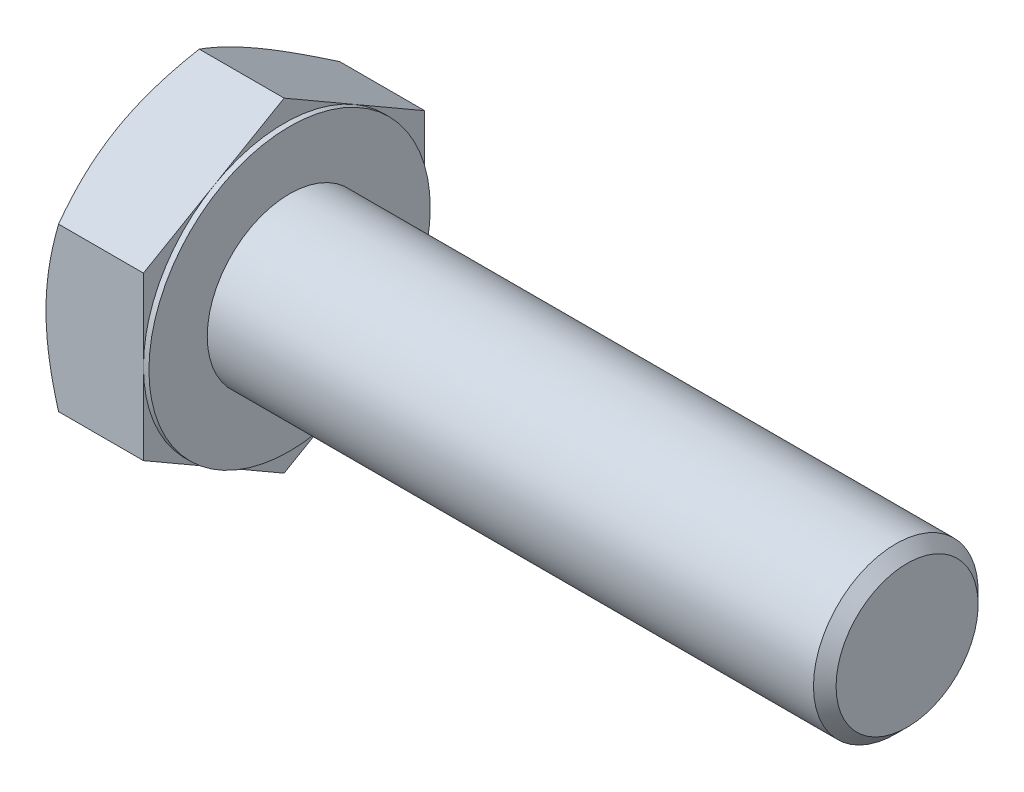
ISO-10303-21;
HEADER;
FILE_DESCRIPTION(('STEP AP214'),'2;1');
FILE_NAME('part.step','',(''),(''),'','','');
FILE_SCHEMA(('AUTOMOTIVE_DESIGN { 1 0 10303 214 1 1 1 1 }'));
ENDSEC;
DATA;
#1=APPLICATION_CONTEXT('core data for automotive mechanical design processes');
#2=APPLICATION_PROTOCOL_DEFINITION('international standard','automotive_design',2000,#1);
#3=PRODUCT_CONTEXT('',#1,'mechanical');
#4=PRODUCT('Part','Part','',(#3));
#5=PRODUCT_RELATED_PRODUCT_CATEGORY('part','',(#4));
#6=PRODUCT_DEFINITION_FORMATION('','',#4);
#7=PRODUCT_DEFINITION_CONTEXT('part definition',#1,'design');
#8=PRODUCT_DEFINITION('design','',#6,#7);
#9=PRODUCT_DEFINITION_SHAPE('','',#8);
#10=(LENGTH_UNIT() NAMED_UNIT(*) SI_UNIT(.MILLI.,.METRE.));
#11=(NAMED_UNIT(*) PLANE_ANGLE_UNIT() SI_UNIT($,.RADIAN.));
#12=(NAMED_UNIT(*) SI_UNIT($,.STERADIAN.) SOLID_ANGLE_UNIT());
#13=UNCERTAINTY_MEASURE_WITH_UNIT(LENGTH_MEASURE(1.E-05),#10,'distance_accuracy_value','');
#14=(GEOMETRIC_REPRESENTATION_CONTEXT(3) GLOBAL_UNCERTAINTY_ASSIGNED_CONTEXT((#13)) GLOBAL_UNIT_ASSIGNED_CONTEXT((#10,
#11,#12)) REPRESENTATION_CONTEXT('',''));
#15=CARTESIAN_POINT('',(0.,0.,0.));
#16=DIRECTION('',(0.,0.,1.));
#17=DIRECTION('',(1.,0.,0.));
#18=AXIS2_PLACEMENT_3D('',#15,#16,#17);
#19=CARTESIAN_POINT('',(15.,23.6713610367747,0.));
#20=DIRECTION('',(1.,0.,0.));
#21=DIRECTION('',(0.,0.,-1.));
#22=AXIS2_PLACEMENT_3D('',#19,#20,#21);
#23=PLANE('',#22);
#24=CARTESIAN_POINT('',(15.,0.,0.));
#25=DIRECTION('',(1.,0.,0.));
#26=DIRECTION('',(0.,0.,-1.));
#27=AXIS2_PLACEMENT_3D('',#24,#25,#26);
#28=CIRCLE('',#27,12.);
#29=CARTESIAN_POINT('',(15.,0.,-12.));
#30=VERTEX_POINT('',#29);
#31=EDGE_CURVE('E275',#30,#30,#28,.F.);
#32=ORIENTED_EDGE('',*,*,#31,.T.);
#33=EDGE_LOOP('',(#32));
#34=FACE_BOUND('',#33,.T.);
#35=CARTESIAN_POINT('',(15.,0.,0.));
#36=DIRECTION('',(1.,0.,0.));
#37=DIRECTION('',(0.,0.,-1.));
#38=AXIS2_PLACEMENT_3D('',#35,#36,#37);
#39=CIRCLE('',#38,20.5);
#40=CARTESIAN_POINT('',(15.,0.,-20.5));
#41=VERTEX_POINT('',#40);
#42=EDGE_CURVE('E294',#41,#41,#39,.T.);
#43=ORIENTED_EDGE('',*,*,#42,.T.);
#44=EDGE_LOOP('',(#43));
#45=FACE_BOUND('',#44,.T.);
#46=ADVANCED_FACE('F37',(#34,#45),#23,.T.);
#47=CARTESIAN_POINT('',(0.,0.,0.));
#48=DIRECTION('',(-1.,0.,0.));
#49=DIRECTION('',(0.,0.,1.));
#50=AXIS2_PLACEMENT_3D('',#47,#48,#49);
#51=CYLINDRICAL_SURFACE('',#50,12.);
#52=ORIENTED_EDGE('',*,*,#31,.F.);
#53=EDGE_LOOP('',(#52));
#54=FACE_BOUND('',#53,.T.);
#55=CARTESIAN_POINT('',(103.352,0.,0.));
#56=DIRECTION('',(-1.,0.,0.));
#57=DIRECTION('',(0.,0.,1.));
#58=AXIS2_PLACEMENT_3D('',#55,#56,#57);
#59=CIRCLE('',#58,12.);
#60=CARTESIAN_POINT('',(103.352,0.,12.));
#61=VERTEX_POINT('',#60);
#62=EDGE_CURVE('E272',#61,#61,#59,.T.);
#63=ORIENTED_EDGE('',*,*,#62,.T.);
#64=EDGE_LOOP('',(#63));
#65=FACE_BOUND('',#64,.T.);
#66=ADVANCED_FACE('F246',(#54,#65),#51,.T.);
#67=CARTESIAN_POINT('',(105.,0.,0.));
#68=DIRECTION('',(-1.,0.,0.));
#69=DIRECTION('',(0.,0.,1.));
#70=AXIS2_PLACEMENT_3D('',#67,#68,#69);
#71=CONICAL_SURFACE('',#70,10.352,0.785398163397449);
#72=ORIENTED_EDGE('',*,*,#62,.F.);
#73=EDGE_LOOP('',(#72));
#74=FACE_BOUND('',#73,.T.);
#75=CARTESIAN_POINT('',(105.,0.,0.));
#76=DIRECTION('',(-1.,0.,0.));
#77=DIRECTION('',(0.,0.,1.));
#78=AXIS2_PLACEMENT_3D('',#75,#76,#77);
#79=CIRCLE('',#78,10.352);
#80=CARTESIAN_POINT('',(105.,0.,10.352));
#81=VERTEX_POINT('',#80);
#82=EDGE_CURVE('E270',#81,#81,#79,.T.);
#83=ORIENTED_EDGE('',*,*,#82,.T.);
#84=EDGE_LOOP('',(#83));
#85=FACE_BOUND('',#84,.T.);
#86=ADVANCED_FACE('F251',(#74,#85),#71,.T.);
#87=CARTESIAN_POINT('',(105.,0.,0.));
#88=DIRECTION('',(-1.,0.,0.));
#89=DIRECTION('',(0.,0.,1.));
#90=AXIS2_PLACEMENT_3D('',#87,#88,#89);
#91=PLANE('',#90);
#92=ORIENTED_EDGE('',*,*,#82,.F.);
#93=EDGE_LOOP('',(#92));
#94=FACE_BOUND('',#93,.T.);
#95=ADVANCED_FACE('F258',(#94),#91,.F.);
#96=CARTESIAN_POINT('',(14.2,20.5,0.));
#97=DIRECTION('',(1.,0.,0.));
#98=DIRECTION('',(0.,0.,-1.));
#99=AXIS2_PLACEMENT_3D('',#96,#97,#98);
#100=PLANE('',#99);
#101=DIRECTION('',(0.,0.500000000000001,0.866025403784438));
#102=VECTOR('',#101,1.);
#103=CARTESIAN_POINT('',(14.2,11.8356805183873,-20.5));
#104=LINE('',#103,#102);
#105=CARTESIAN_POINT('',(14.2,11.8356805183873,-20.5));
#106=VERTEX_POINT('',#105);
#107=CARTESIAN_POINT('',(14.2,17.753520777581,-10.25));
#108=VERTEX_POINT('',#107);
#109=EDGE_CURVE('E170',#106,#108,#104,.T.);
#110=ORIENTED_EDGE('',*,*,#109,.T.);
#111=CARTESIAN_POINT('',(14.2,0.,0.));
#112=DIRECTION('',(-1.,0.,0.));
#113=DIRECTION('',(0.,0.,1.));
#114=AXIS2_PLACEMENT_3D('',#111,#112,#113);
#115=CIRCLE('',#114,20.5);
#116=CARTESIAN_POINT('',(14.2,0.,-20.5));
#117=VERTEX_POINT('',#116);
#118=EDGE_CURVE('E53',#108,#117,#115,.T.);
#119=ORIENTED_EDGE('',*,*,#118,.T.);
#120=DIRECTION('',(0.,1.,0.));
#121=VECTOR('',#120,1.);
#122=CARTESIAN_POINT('',(14.2,11.8356805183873,-20.5));
#123=LINE('',#122,#121);
#124=EDGE_CURVE('E42',#117,#106,#123,.T.);
#125=ORIENTED_EDGE('',*,*,#124,.T.);
#126=EDGE_LOOP('',(#110,#119,#125));
#127=FACE_BOUND('',#126,.T.);
#128=ADVANCED_FACE('F261',(#127),#100,.T.);
#129=CARTESIAN_POINT('',(14.2,23.6713610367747,0.));
#130=VERTEX_POINT('',#129);
#131=EDGE_CURVE('E168',#108,#130,#104,.T.);
#132=ORIENTED_EDGE('',*,*,#131,.T.);
#133=DIRECTION('',(0.,-0.500000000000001,0.866025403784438));
#134=VECTOR('',#133,1.);
#135=CARTESIAN_POINT('',(14.2,23.6713610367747,0.));
#136=LINE('',#135,#134);
#137=CARTESIAN_POINT('',(14.2,17.753520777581,10.25));
#138=VERTEX_POINT('',#137);
#139=EDGE_CURVE('E167',#130,#138,#136,.T.);
#140=ORIENTED_EDGE('',*,*,#139,.T.);
#141=EDGE_CURVE('E156',#138,#108,#115,.T.);
#142=ORIENTED_EDGE('',*,*,#141,.T.);
#143=EDGE_LOOP('',(#132,#140,#142));
#144=FACE_BOUND('',#143,.T.);
#145=ADVANCED_FACE('F266',(#144),#100,.T.);
#146=CARTESIAN_POINT('',(14.2,11.8356805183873,20.5));
#147=VERTEX_POINT('',#146);
#148=EDGE_CURVE('E135',#138,#147,#136,.T.);
#149=ORIENTED_EDGE('',*,*,#148,.T.);
#150=DIRECTION('',(0.,-1.,0.));
#151=VECTOR('',#150,1.);
#152=CARTESIAN_POINT('',(14.2,11.8356805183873,20.5));
#153=LINE('',#152,#151);
#154=CARTESIAN_POINT('',(14.2,0.,20.5));
#155=VERTEX_POINT('',#154);
#156=EDGE_CURVE('E129',#147,#155,#153,.T.);
#157=ORIENTED_EDGE('',*,*,#156,.T.);
#158=EDGE_CURVE('E133',#155,#138,#115,.T.);
#159=ORIENTED_EDGE('',*,*,#158,.T.);
#160=EDGE_LOOP('',(#149,#157,#159));
#161=FACE_BOUND('',#160,.T.);
#162=ADVANCED_FACE('F131',(#161),#100,.T.);
#163=CARTESIAN_POINT('',(14.2,-11.8356805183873,20.5));
#164=VERTEX_POINT('',#163);
#165=EDGE_CURVE('E139',#155,#164,#153,.T.);
#166=ORIENTED_EDGE('',*,*,#165,.T.);
#167=DIRECTION('',(0.,-0.500000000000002,-0.866025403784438));
#168=VECTOR('',#167,1.);
#169=CARTESIAN_POINT('',(14.2,-23.6713610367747,0.));
#170=LINE('',#169,#168);
#171=CARTESIAN_POINT('',(14.2,-17.753520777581,10.25));
#172=VERTEX_POINT('',#171);
#173=EDGE_CURVE('E146',#164,#172,#170,.T.);
#174=ORIENTED_EDGE('',*,*,#173,.T.);
#175=EDGE_CURVE('E143',#172,#155,#115,.T.);
#176=ORIENTED_EDGE('',*,*,#175,.T.);
#177=EDGE_LOOP('',(#166,#174,#176));
#178=FACE_BOUND('',#177,.T.);
#179=ADVANCED_FACE('F144',(#178),#100,.T.);
#180=CARTESIAN_POINT('',(14.2,-23.6713610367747,0.));
#181=VERTEX_POINT('',#180);
#182=EDGE_CURVE('E162',#172,#181,#170,.T.);
#183=ORIENTED_EDGE('',*,*,#182,.T.);
#184=DIRECTION('',(0.,0.5,-0.866025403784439));
#185=VECTOR('',#184,1.);
#186=CARTESIAN_POINT('',(14.2,-11.8356805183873,-20.5));
#187=LINE('',#186,#185);
#188=CARTESIAN_POINT('',(14.2,-17.753520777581,-10.25));
#189=VERTEX_POINT('',#188);
#190=EDGE_CURVE('E330',#181,#189,#187,.T.);
#191=ORIENTED_EDGE('',*,*,#190,.T.);
#192=EDGE_CURVE('E150',#189,#172,#115,.T.);
#193=ORIENTED_EDGE('',*,*,#192,.T.);
#194=EDGE_LOOP('',(#183,#191,#193));
#195=FACE_BOUND('',#194,.T.);
#196=ADVANCED_FACE('F335',(#195),#100,.T.);
#197=CARTESIAN_POINT('',(14.2,-11.8356805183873,-20.5));
#198=VERTEX_POINT('',#197);
#199=EDGE_CURVE('E157',#189,#198,#187,.T.);
#200=ORIENTED_EDGE('',*,*,#199,.T.);
#201=EDGE_CURVE('E11',#198,#117,#123,.T.);
#202=ORIENTED_EDGE('',*,*,#201,.T.);
#203=EDGE_CURVE('E348',#117,#189,#115,.T.);
#204=ORIENTED_EDGE('',*,*,#203,.T.);
#205=EDGE_LOOP('',(#200,#202,#204));
#206=FACE_BOUND('',#205,.T.);
#207=ADVANCED_FACE('F267',(#206),#100,.T.);
#208=CARTESIAN_POINT('',(0.,0.,0.));
#209=DIRECTION('',(-1.,0.,0.));
#210=DIRECTION('',(0.,0.,1.));
#211=AXIS2_PLACEMENT_3D('',#208,#209,#210);
#212=CYLINDRICAL_SURFACE('',#211,20.5);
#213=ORIENTED_EDGE('',*,*,#118,.F.);
#214=ORIENTED_EDGE('',*,*,#141,.F.);
#215=ORIENTED_EDGE('',*,*,#158,.F.);
#216=ORIENTED_EDGE('',*,*,#175,.F.);
#217=ORIENTED_EDGE('',*,*,#192,.F.);
#218=ORIENTED_EDGE('',*,*,#203,.F.);
#219=EDGE_LOOP('',(#213,#214,#215,#216,#217,#218));
#220=FACE_BOUND('',#219,.T.);
#221=ORIENTED_EDGE('',*,*,#42,.F.);
#222=EDGE_LOOP('',(#221));
#223=FACE_BOUND('',#222,.T.);
#224=ADVANCED_FACE('F153',(#220,#223),#212,.T.);
#225=CARTESIAN_POINT('',(0.,23.6713610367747,0.));
#226=DIRECTION('',(1.,0.,0.));
#227=DIRECTION('',(0.,0.,-1.));
#228=AXIS2_PLACEMENT_3D('',#225,#226,#227);
#229=PLANE('',#228);
#230=CARTESIAN_POINT('',(0.,0.,0.));
#231=DIRECTION('',(1.,0.,0.));
#232=DIRECTION('',(0.,0.,-1.));
#233=AXIS2_PLACEMENT_3D('',#230,#231,#232);
#234=CIRCLE('',#233,20.5);
#235=CARTESIAN_POINT('',(0.,0.,-20.5));
#236=VERTEX_POINT('',#235);
#237=CARTESIAN_POINT('',(0.,17.753520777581,-10.25));
#238=VERTEX_POINT('',#237);
#239=EDGE_CURVE('E293',#236,#238,#234,.T.);
#240=ORIENTED_EDGE('',*,*,#239,.F.);
#241=CARTESIAN_POINT('',(0.,-17.753520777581,-10.25));
#242=VERTEX_POINT('',#241);
#243=EDGE_CURVE('E290',#242,#236,#234,.T.);
#244=ORIENTED_EDGE('',*,*,#243,.F.);
#245=CARTESIAN_POINT('',(0.,-17.753520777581,10.25));
#246=VERTEX_POINT('',#245);
#247=EDGE_CURVE('E292',#246,#242,#234,.T.);
#248=ORIENTED_EDGE('',*,*,#247,.F.);
#249=CARTESIAN_POINT('',(0.,0.,20.5));
#250=VERTEX_POINT('',#249);
#251=EDGE_CURVE('E302',#250,#246,#234,.T.);
#252=ORIENTED_EDGE('',*,*,#251,.F.);
#253=CARTESIAN_POINT('',(0.,0.,0.));
#254=DIRECTION('',(-1.,0.,0.));
#255=DIRECTION('',(0.,0.,1.));
#256=AXIS2_PLACEMENT_3D('',#253,#254,#255);
#257=CIRCLE('',#256,20.5);
#258=CARTESIAN_POINT('',(0.,17.753520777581,10.25));
#259=VERTEX_POINT('',#258);
#260=EDGE_CURVE('E171',#250,#259,#257,.T.);
#261=ORIENTED_EDGE('',*,*,#260,.T.);
#262=EDGE_CURVE('E297',#238,#259,#234,.T.);
#263=ORIENTED_EDGE('',*,*,#262,.F.);
#264=EDGE_LOOP('',(#240,#244,#248,#252,#261,#263));
#265=FACE_BOUND('',#264,.T.);
#266=ADVANCED_FACE('F200',(#265),#229,.F.);
#267=CARTESIAN_POINT('',(0.,0.,0.));
#268=DIRECTION('',(1.,0.,0.));
#269=DIRECTION('',(0.,0.,-1.));
#270=AXIS2_PLACEMENT_3D('',#267,#268,#269);
#271=CONICAL_SURFACE('',#270,20.5,1.0471975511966);
#272=CARTESIAN_POINT('',(1.83105281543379,11.8355650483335,20.5002));
#273=CARTESIAN_POINT('',(1.68086967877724,12.0957082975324,20.0496186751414));
#274=CARTESIAN_POINT('',(1.5375016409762,12.3568662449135,19.5972798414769));
#275=CARTESIAN_POINT('',(1.26629011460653,12.8812763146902,18.688974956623));
#276=CARTESIAN_POINT('',(1.13845173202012,13.1445290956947,18.2330077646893));
#277=CARTESIAN_POINT('',(0.900017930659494,13.6736376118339,17.3165649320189));
#278=CARTESIAN_POINT('',(0.78946331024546,13.9394979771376,16.8560812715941));
#279=CARTESIAN_POINT('',(0.58797100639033,14.4730660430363,15.9319142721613));
#280=CARTESIAN_POINT('',(0.497032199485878,14.7407736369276,15.4682311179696));
#281=CARTESIAN_POINT('',(0.338639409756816,15.2711766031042,14.5495462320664));
#282=CARTESIAN_POINT('',(0.27066117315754,15.5338325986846,14.0946127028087));
#283=CARTESIAN_POINT('',(0.156677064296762,16.0603481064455,13.1826610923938));
#284=CARTESIAN_POINT('',(0.110671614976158,16.3242076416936,12.7256429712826));
#285=CARTESIAN_POINT('',(0.0417946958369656,16.8523699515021,11.8108390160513));
#286=CARTESIAN_POINT('',(0.0188957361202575,17.1166718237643,11.3530547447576));
#287=CARTESIAN_POINT('',(-0.00327576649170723,17.6455194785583,10.4370637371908));
#288=CARTESIAN_POINT('',(-0.00254903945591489,17.9100652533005,9.97885701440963));
#289=CARTESIAN_POINT('',(0.0208807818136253,18.4046387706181,9.1222305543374));
#290=CARTESIAN_POINT('',(0.0407268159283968,18.6347017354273,8.72374981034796));
#291=CARTESIAN_POINT('',(0.097910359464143,19.094278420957,7.92773964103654));
#292=CARTESIAN_POINT('',(0.135247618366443,19.3237921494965,7.53021020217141));
#293=CARTESIAN_POINT('',(0.226766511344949,19.7821855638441,6.73624951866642));
#294=CARTESIAN_POINT('',(0.280963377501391,20.0110644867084,6.33981959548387));
#295=CARTESIAN_POINT('',(0.405242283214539,20.4677264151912,5.54885793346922));
#296=CARTESIAN_POINT('',(0.475324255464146,20.6955094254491,5.15432618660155));
#297=CARTESIAN_POINT('',(0.71119638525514,21.387010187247,3.95661173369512));
#298=CARTESIAN_POINT('',(0.900518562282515,21.8487632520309,3.15683196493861));
#299=CARTESIAN_POINT('',(1.22283076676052,22.5362934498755,1.96599473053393));
#300=CARTESIAN_POINT('',(1.3365403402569,22.7644232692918,1.57086229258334));
#301=CARTESIAN_POINT('',(1.57547119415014,23.2191049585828,0.783330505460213));
#302=CARTESIAN_POINT('',(1.70068922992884,23.4456572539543,0.390930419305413));
#303=CARTESIAN_POINT('',(1.83105281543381,23.6714765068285,-0.000200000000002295));
#304=B_SPLINE_CURVE_WITH_KNOTS('',3,(#272,#273,#274,#275,#276,#277,#278,#279,#280,#281,#282,
#283,#284,#285,#286,#287,#288,#289,#290,#291,#292,#293,#294,#295,#296,#297,#298,#299,#300,#301,
#302,#303),.UNSPECIFIED.,.F.,.F.,(4,2,2,2,2,2,2,2,2,2,2,2,2,2,2,4),(0.,1.62462772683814,
3.24978817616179,4.87872871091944,6.50757592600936,8.09621981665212,9.68489428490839,
11.2716764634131,12.8584096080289,14.2397371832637,15.6210449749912,17.0036043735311,
18.3861579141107,21.2121645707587,22.6227063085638,24.0328515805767),.UNSPECIFIED.);
#305=CARTESIAN_POINT('',(1.83098614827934,23.6713610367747,0.));
#306=VERTEX_POINT('',#305);
#307=EDGE_CURVE('E218',#259,#306,#304,.T.);
#308=ORIENTED_EDGE('',*,*,#307,.T.);
#309=CARTESIAN_POINT('',(1.83105281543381,23.6714765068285,0.000199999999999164));
#310=CARTESIAN_POINT('',(1.68086967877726,23.4113332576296,-0.450381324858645));
#311=CARTESIAN_POINT('',(1.53750164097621,23.1501753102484,-0.902720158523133));
#312=CARTESIAN_POINT('',(1.26629011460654,22.6257652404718,-1.81102504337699));
#313=CARTESIAN_POINT('',(1.13845173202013,22.3625124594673,-2.26699223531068));
#314=CARTESIAN_POINT('',(0.9000179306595,21.8334039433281,-3.1834350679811));
#315=CARTESIAN_POINT('',(0.789463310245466,21.5675435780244,-3.6439187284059));
#316=CARTESIAN_POINT('',(0.587971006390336,21.0339755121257,-4.5680857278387));
#317=CARTESIAN_POINT('',(0.497032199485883,20.7662679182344,-5.03176888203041));
#318=CARTESIAN_POINT('',(0.338639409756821,20.2358649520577,-5.95045376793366));
#319=CARTESIAN_POINT('',(0.270661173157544,19.9732089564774,-6.40538729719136));
#320=CARTESIAN_POINT('',(0.156677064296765,19.4466934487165,-7.3173389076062));
#321=CARTESIAN_POINT('',(0.110671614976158,19.1828339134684,-7.77435702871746));
#322=CARTESIAN_POINT('',(0.0417946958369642,18.6546716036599,-8.6891609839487));
#323=CARTESIAN_POINT('',(0.0188957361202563,18.3903697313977,-9.14694525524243));
#324=CARTESIAN_POINT('',(-0.00327576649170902,17.8615220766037,-10.0629362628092));
#325=CARTESIAN_POINT('',(-0.00254903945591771,17.5969763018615,-10.5211429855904));
#326=CARTESIAN_POINT('',(0.0208807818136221,17.1024027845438,-11.3777694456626));
#327=CARTESIAN_POINT('',(0.0407268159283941,16.8723398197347,-11.7762501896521));
#328=CARTESIAN_POINT('',(0.0979103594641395,16.412763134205,-12.5722603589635));
#329=CARTESIAN_POINT('',(0.135247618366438,16.1832494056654,-12.9697897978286));
#330=CARTESIAN_POINT('',(0.226766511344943,15.7248559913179,-13.7637504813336));
#331=CARTESIAN_POINT('',(0.280963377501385,15.4959770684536,-14.1601804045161));
#332=CARTESIAN_POINT('',(0.40524228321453,15.0393151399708,-14.9511420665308));
#333=CARTESIAN_POINT('',(0.475324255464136,14.8115321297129,-15.3456738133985));
#334=CARTESIAN_POINT('',(0.711196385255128,14.120031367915,-16.5433882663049));
#335=CARTESIAN_POINT('',(0.900518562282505,13.658278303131,-17.3431680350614));
#336=CARTESIAN_POINT('',(1.22283076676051,12.9707481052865,-18.5340052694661));
#337=CARTESIAN_POINT('',(1.33654034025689,12.7426182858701,-18.9291377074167));
#338=CARTESIAN_POINT('',(1.57547119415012,12.2879365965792,-19.7166694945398));
#339=CARTESIAN_POINT('',(1.70068922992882,12.0613843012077,-20.1090695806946));
#340=CARTESIAN_POINT('',(1.83105281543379,11.8355650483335,-20.5002));
#341=B_SPLINE_CURVE_WITH_KNOTS('',3,(#309,#310,#311,#312,#313,#314,#315,#316,#317,#318,#319,
#320,#321,#322,#323,#324,#325,#326,#327,#328,#329,#330,#331,#332,#333,#334,#335,#336,#337,#338,
#339,#340),.UNSPECIFIED.,.F.,.F.,(4,2,2,2,2,2,2,2,2,2,2,2,2,2,2,4),(0.,1.62462772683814,
3.24978817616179,4.87872871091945,6.50757592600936,8.09621981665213,9.6848942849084,
11.2716764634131,12.8584096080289,14.2397371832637,15.6210449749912,17.0036043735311,
18.3861579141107,21.2121645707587,22.6227063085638,24.0328515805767),.UNSPECIFIED.);
#342=EDGE_CURVE('E61',#306,#238,#341,.T.);
#343=ORIENTED_EDGE('',*,*,#342,.T.);
#344=ORIENTED_EDGE('',*,*,#262,.T.);
#345=EDGE_LOOP('',(#308,#343,#344));
#346=FACE_BOUND('',#345,.T.);
#347=ADVANCED_FACE('F344',(#346),#271,.T.);
#348=CARTESIAN_POINT('',(10.0045735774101,-31.7921389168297,20.5));
#349=CARTESIAN_POINT('',(9.78736329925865,-31.3444790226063,20.5));
#350=CARTESIAN_POINT('',(9.57123614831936,-30.896293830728,20.5));
#351=CARTESIAN_POINT('',(9.14139340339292,-29.9987632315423,20.5));
#352=CARTESIAN_POINT('',(8.92767783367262,-29.5494178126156,20.5));
#353=CARTESIAN_POINT('',(8.29046013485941,-28.1993571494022,20.5));
#354=CARTESIAN_POINT('',(7.87095143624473,-27.2967499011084,20.5));
#355=CARTESIAN_POINT('',(7.04286118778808,-25.480583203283,20.5));
#356=CARTESIAN_POINT('',(6.63435156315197,-24.5669908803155,20.5));
#357=CARTESIAN_POINT('',(5.83404260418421,-22.7325410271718,20.5));
#358=CARTESIAN_POINT('',(5.44224248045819,-21.8116838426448,20.5));
#359=CARTESIAN_POINT('',(4.66751070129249,-19.9314771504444,20.5));
#360=CARTESIAN_POINT('',(4.28526901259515,-18.9718418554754,20.5));
#361=CARTESIAN_POINT('',(3.54971359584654,-17.0413372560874,20.5));
#362=CARTESIAN_POINT('',(3.19640311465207,-16.070466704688,20.5));
#363=CARTESIAN_POINT('',(2.52799067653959,-14.1177960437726,20.5));
#364=CARTESIAN_POINT('',(2.2128113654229,-13.1360226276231,20.5));
#365=CARTESIAN_POINT('',(1.63075735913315,-11.1582993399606,20.5));
#366=CARTESIAN_POINT('',(1.36386744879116,-10.1623540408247,20.5));
#367=CARTESIAN_POINT('',(1.01013936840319,-8.66039751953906,20.5));
#368=CARTESIAN_POINT('',(0.900235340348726,-8.15978559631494,20.5));
#369=CARTESIAN_POINT('',(0.697271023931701,-7.15514108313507,20.5));
#370=CARTESIAN_POINT('',(0.604210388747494,-6.65110856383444,20.5));
#371=CARTESIAN_POINT('',(0.436577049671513,-5.63997954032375,20.5));
#372=CARTESIAN_POINT('',(0.362003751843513,-5.13288313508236,20.5));
#373=CARTESIAN_POINT('',(0.232828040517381,-4.11613536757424,20.5));
#374=CARTESIAN_POINT('',(0.178225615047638,-3.60648400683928,20.5));
#375=CARTESIAN_POINT('',(0.0907657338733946,-2.5920207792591,20.5));
#376=CARTESIAN_POINT('',(0.0576332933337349,-2.08723276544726,20.5));
#377=CARTESIAN_POINT('',(0.0127447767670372,-1.07670899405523,20.5));
#378=CARTESIAN_POINT('',(0.000988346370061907,-0.57097325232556,20.5));
#379=CARTESIAN_POINT('',(-0.000868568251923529,0.440543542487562,20.5));
#380=CARTESIAN_POINT('',(0.00903105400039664,0.946324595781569,20.5));
#381=CARTESIAN_POINT('',(0.050244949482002,1.957018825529,20.5));
#382=CARTESIAN_POINT('',(0.0815601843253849,2.46193196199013,20.5));
#383=CARTESIAN_POINT('',(0.181892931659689,3.67541240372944,20.5));
#384=CARTESIAN_POINT('',(0.261072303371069,4.38315427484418,20.5));
#385=CARTESIAN_POINT('',(0.457195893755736,5.79338947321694,20.5));
#386=CARTESIAN_POINT('',(0.574145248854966,6.49588207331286,20.5));
#387=CARTESIAN_POINT('',(0.841648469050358,7.89494840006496,20.5));
#388=CARTESIAN_POINT('',(0.992228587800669,8.59151705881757,20.5));
#389=CARTESIAN_POINT('',(1.32239799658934,9.97766865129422,20.5));
#390=CARTESIAN_POINT('',(1.50198684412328,10.6672516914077,20.5));
#391=CARTESIAN_POINT('',(1.89003635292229,12.0545545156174,20.5));
#392=CARTESIAN_POINT('',(2.09904485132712,12.7521199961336,20.5));
#393=CARTESIAN_POINT('',(2.538641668,14.1403793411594,20.5));
#394=CARTESIAN_POINT('',(2.76923012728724,14.8310731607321,20.5));
#395=CARTESIAN_POINT('',(3.2483270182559,16.2059303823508,20.5));
#396=CARTESIAN_POINT('',(3.49682946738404,16.8900958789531,20.5));
#397=CARTESIAN_POINT('',(4.00883234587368,18.2527591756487,20.5));
#398=CARTESIAN_POINT('',(4.27233260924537,18.9312570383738,20.5));
#399=CARTESIAN_POINT('',(4.90504075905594,20.5167699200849,20.5));
#400=CARTESIAN_POINT('',(5.27932054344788,21.421757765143,20.5));
#401=CARTESIAN_POINT('',(6.04577825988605,23.224144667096,20.5));
#402=CARTESIAN_POINT('',(6.43795725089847,24.121543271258,20.5));
#403=CARTESIAN_POINT('',(7.23667478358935,25.9101426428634,20.5));
#404=CARTESIAN_POINT('',(7.64321640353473,26.8013420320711,20.5));
#405=CARTESIAN_POINT('',(8.46779917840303,28.5783696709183,20.5));
#406=CARTESIAN_POINT('',(8.88584009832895,29.4641980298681,20.5));
#407=CARTESIAN_POINT('',(9.73174717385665,31.232304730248,20.5));
#408=CARTESIAN_POINT('',(10.1596233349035,32.1145782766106,20.5));
#409=CARTESIAN_POINT('',(11.023106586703,33.8753332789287,20.5));
#410=CARTESIAN_POINT('',(11.458713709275,34.753814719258,20.5));
#411=CARTESIAN_POINT('',(12.336294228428,36.5074549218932,20.5));
#412=CARTESIAN_POINT('',(12.7782668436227,37.3826140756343,20.5));
#413=CARTESIAN_POINT('',(13.6675972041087,39.1301871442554,20.5));
#414=CARTESIAN_POINT('',(14.1149549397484,40.0026010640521,20.5));
#415=CARTESIAN_POINT('',(15.3896420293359,42.4725798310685,20.5));
#416=CARTESIAN_POINT('',(16.2223378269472,44.0673751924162,20.5));
#417=CARTESIAN_POINT('',(17.8991647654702,47.250997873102,20.5));
#418=CARTESIAN_POINT('',(18.7432962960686,48.8398249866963,20.5));
#419=CARTESIAN_POINT('',(20.4382614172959,52.0089141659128,20.5));
#420=CARTESIAN_POINT('',(21.2890736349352,53.589187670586,20.5));
#421=CARTESIAN_POINT('',(22.5704014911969,55.9567745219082,20.5));
#422=CARTESIAN_POINT('',(22.9983509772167,56.7454787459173,20.5));
#423=CARTESIAN_POINT('',(23.8557834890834,58.3220516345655,20.5));
#424=CARTESIAN_POINT('',(24.2852665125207,59.1099203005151,20.5));
#425=CARTESIAN_POINT('',(24.7154284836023,59.8974182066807,20.5));
#426=B_SPLINE_CURVE_WITH_KNOTS('',3,(#348,#349,#350,#351,#352,#353,#354,#355,#356,#357,#358,
#359,#360,#361,#362,#363,#364,#365,#366,#367,#368,#369,#370,#371,#372,#373,#374,#375,#376,#377,
#378,#379,#380,#381,#382,#383,#384,#385,#386,#387,#388,#389,#390,#391,#392,#393,#394,#395,#396,
#397,#398,#399,#400,#401,#402,#403,#404,#405,#406,#407,#408,#409,#410,#411,#412,#413,#414,#415,
#416,#417,#418,#419,#420,#421,#422,#423,#424,#425),.UNSPECIFIED.,.F.,.F.,(4,2,2,2,2,2,2,2,2,2,2,
2,2,2,2,2,2,2,2,2,2,2,2,2,2,2,2,2,2,2,2,2,2,2,2,2,2,2,4),(0.,1.49271869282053,2.98545239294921,
5.97136149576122,8.97352680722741,11.9755501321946,15.07407723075,18.1729515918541,
21.2654301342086,24.3569325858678,25.8942973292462,27.4316304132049,28.9689141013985,
30.5061968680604,32.0233793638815,33.5405367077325,35.0577015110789,36.5749344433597,
38.7102245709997,40.8458052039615,42.9830588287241,45.1202798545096,47.3044767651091,
49.4886879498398,51.6721730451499,53.8556339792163,56.7933660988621,59.7312722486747,
62.669811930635,65.6082916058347,68.5499059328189,71.4915323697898,74.4328007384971,
77.374063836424,82.771288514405,88.168697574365,93.5529397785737,96.2449184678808,
98.9368929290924),.UNSPECIFIED.);
#427=CARTESIAN_POINT('',(1.83098614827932,11.8356805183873,20.5));
#428=VERTEX_POINT('',#427);
#429=EDGE_CURVE('E230',#250,#428,#426,.T.);
#430=ORIENTED_EDGE('',*,*,#429,.T.);
#431=EDGE_CURVE('E229',#428,#259,#304,.T.);
#432=ORIENTED_EDGE('',*,*,#431,.T.);
#433=ORIENTED_EDGE('',*,*,#260,.F.);
#434=EDGE_LOOP('',(#430,#432,#433));
#435=FACE_BOUND('',#434,.T.);
#436=ADVANCED_FACE('F340',(#435),#271,.T.);
#437=CARTESIAN_POINT('',(1.83098614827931,-11.8356805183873,20.5));
#438=VERTEX_POINT('',#437);
#439=EDGE_CURVE('E273',#438,#250,#426,.T.);
#440=ORIENTED_EDGE('',*,*,#439,.T.);
#441=ORIENTED_EDGE('',*,*,#251,.T.);
#442=CARTESIAN_POINT('',(1.83105281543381,-23.6714765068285,-0.000200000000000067));
#443=CARTESIAN_POINT('',(1.68086967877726,-23.4113332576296,0.450381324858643));
#444=CARTESIAN_POINT('',(1.53750164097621,-23.1501753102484,0.90272015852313));
#445=CARTESIAN_POINT('',(1.26629011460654,-22.6257652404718,1.81102504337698));
#446=CARTESIAN_POINT('',(1.13845173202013,-22.3625124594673,2.26699223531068));
#447=CARTESIAN_POINT('',(0.900017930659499,-21.8334039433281,3.1834350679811));
#448=CARTESIAN_POINT('',(0.789463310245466,-21.5675435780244,3.64391872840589));
#449=CARTESIAN_POINT('',(0.587971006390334,-21.0339755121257,4.56808572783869));
#450=CARTESIAN_POINT('',(0.497032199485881,-20.7662679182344,5.0317688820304));
#451=CARTESIAN_POINT('',(0.338639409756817,-20.2358649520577,5.95045376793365));
#452=CARTESIAN_POINT('',(0.27066117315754,-19.9732089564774,6.40538729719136));
#453=CARTESIAN_POINT('',(0.156677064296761,-19.4466934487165,7.31733890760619));
#454=CARTESIAN_POINT('',(0.110671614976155,-19.1828339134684,7.77435702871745));
#455=CARTESIAN_POINT('',(0.0417946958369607,-18.6546716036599,8.68916098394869));
#456=CARTESIAN_POINT('',(0.0188957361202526,-18.3903697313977,9.14694525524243));
#457=CARTESIAN_POINT('',(-0.00327576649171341,-17.8615220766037,10.0629362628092));
#458=CARTESIAN_POINT('',(-0.00254903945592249,-17.5969763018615,10.5211429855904));
#459=CARTESIAN_POINT('',(0.020880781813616,-17.1024027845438,11.3777694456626));
#460=CARTESIAN_POINT('',(0.040726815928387,-16.8723398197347,11.776250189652));
#461=CARTESIAN_POINT('',(0.0979103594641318,-16.412763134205,12.5722603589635));
#462=CARTESIAN_POINT('',(0.135247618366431,-16.1832494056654,12.9697897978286));
#463=CARTESIAN_POINT('',(0.226766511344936,-15.7248559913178,13.7637504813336));
#464=CARTESIAN_POINT('',(0.280963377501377,-15.4959770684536,14.1601804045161));
#465=CARTESIAN_POINT('',(0.405242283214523,-15.0393151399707,14.9511420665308));
#466=CARTESIAN_POINT('',(0.47532425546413,-14.8115321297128,15.3456738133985));
#467=CARTESIAN_POINT('',(0.711196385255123,-14.120031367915,16.5433882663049));
#468=CARTESIAN_POINT('',(0.900518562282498,-13.658278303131,17.3431680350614));
#469=CARTESIAN_POINT('',(1.2228307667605,-12.9707481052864,18.5340052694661));
#470=CARTESIAN_POINT('',(1.33654034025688,-12.7426182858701,18.9291377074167));
#471=CARTESIAN_POINT('',(1.57547119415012,-12.2879365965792,19.7166694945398));
#472=CARTESIAN_POINT('',(1.70068922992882,-12.0613843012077,20.1090695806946));
#473=CARTESIAN_POINT('',(1.83105281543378,-11.8355650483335,20.5002));
#474=B_SPLINE_CURVE_WITH_KNOTS('',3,(#442,#443,#444,#445,#446,#447,#448,#449,#450,#451,#452,
#453,#454,#455,#456,#457,#458,#459,#460,#461,#462,#463,#464,#465,#466,#467,#468,#469,#470,#471,
#472,#473),.UNSPECIFIED.,.F.,.F.,(4,2,2,2,2,2,2,2,2,2,2,2,2,2,2,4),(0.,1.62462772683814,
3.24978817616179,4.87872871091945,6.50757592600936,8.09621981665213,9.6848942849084,
11.2716764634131,12.8584096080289,14.2397371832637,15.6210449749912,17.0036043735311,
18.3861579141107,21.2121645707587,22.6227063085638,24.0328515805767),.UNSPECIFIED.);
#475=EDGE_CURVE('E220',#246,#438,#474,.T.);
#476=ORIENTED_EDGE('',*,*,#475,.T.);
#477=EDGE_LOOP('',(#440,#441,#476));
#478=FACE_BOUND('',#477,.T.);
#479=ADVANCED_FACE('F189',(#478),#271,.T.);
#480=CARTESIAN_POINT('',(1.83098614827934,-23.6713610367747,0.));
#481=VERTEX_POINT('',#480);
#482=EDGE_CURVE('E213',#481,#246,#474,.T.);
#483=ORIENTED_EDGE('',*,*,#482,.T.);
#484=ORIENTED_EDGE('',*,*,#247,.T.);
#485=CARTESIAN_POINT('',(1.8310528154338,-11.8355650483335,-20.5002));
#486=CARTESIAN_POINT('',(1.68086967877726,-12.0957082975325,-20.0496186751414));
#487=CARTESIAN_POINT('',(1.53750164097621,-12.3568662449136,-19.5972798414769));
#488=CARTESIAN_POINT('',(1.26629011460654,-12.8812763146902,-18.688974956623));
#489=CARTESIAN_POINT('',(1.13845173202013,-13.1445290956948,-18.2330077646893));
#490=CARTESIAN_POINT('',(0.900017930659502,-13.6736376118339,-17.3165649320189));
#491=CARTESIAN_POINT('',(0.789463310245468,-13.9394979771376,-16.8560812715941));
#492=CARTESIAN_POINT('',(0.587971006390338,-14.4730660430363,-15.9319142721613));
#493=CARTESIAN_POINT('',(0.497032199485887,-14.7407736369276,-15.4682311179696));
#494=CARTESIAN_POINT('',(0.338639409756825,-15.2711766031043,-14.5495462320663));
#495=CARTESIAN_POINT('',(0.270661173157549,-15.5338325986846,-14.0946127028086));
#496=CARTESIAN_POINT('',(0.156677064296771,-16.0603481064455,-13.1826610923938));
#497=CARTESIAN_POINT('',(0.110671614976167,-16.3242076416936,-12.7256429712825));
#498=CARTESIAN_POINT('',(0.0417946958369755,-16.8523699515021,-11.8108390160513));
#499=CARTESIAN_POINT('',(0.0188957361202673,-17.1166718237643,-11.3530547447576));
#500=CARTESIAN_POINT('',(-0.00327576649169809,-17.6455194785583,-10.4370637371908));
#501=CARTESIAN_POINT('',(-0.00254903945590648,-17.9100652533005,-9.97885701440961));
#502=CARTESIAN_POINT('',(0.0208807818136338,-18.4046387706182,-9.12223055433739));
#503=CARTESIAN_POINT('',(0.0407268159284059,-18.6347017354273,-8.72374981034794));
#504=CARTESIAN_POINT('',(0.0979103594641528,-19.094278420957,-7.92773964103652));
#505=CARTESIAN_POINT('',(0.135247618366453,-19.3237921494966,-7.53021020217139));
#506=CARTESIAN_POINT('',(0.226766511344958,-19.7821855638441,-6.7362495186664));
#507=CARTESIAN_POINT('',(0.280963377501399,-20.0110644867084,-6.33981959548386));
#508=CARTESIAN_POINT('',(0.405242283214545,-20.4677264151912,-5.54885793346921));
#509=CARTESIAN_POINT('',(0.475324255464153,-20.6955094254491,-5.15432618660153));
#510=CARTESIAN_POINT('',(0.711196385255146,-21.387010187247,-3.95661173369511));
#511=CARTESIAN_POINT('',(0.90051856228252,-21.848763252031,-3.1568319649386));
#512=CARTESIAN_POINT('',(1.22283076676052,-22.5362934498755,-1.96599473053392));
#513=CARTESIAN_POINT('',(1.3365403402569,-22.7644232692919,-1.57086229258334));
#514=CARTESIAN_POINT('',(1.57547119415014,-23.2191049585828,-0.783330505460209));
#515=CARTESIAN_POINT('',(1.70068922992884,-23.4456572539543,-0.39093041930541));
#516=CARTESIAN_POINT('',(1.83105281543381,-23.6714765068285,0.000200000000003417));
#517=B_SPLINE_CURVE_WITH_KNOTS('',3,(#485,#486,#487,#488,#489,#490,#491,#492,#493,#494,#495,
#496,#497,#498,#499,#500,#501,#502,#503,#504,#505,#506,#507,#508,#509,#510,#511,#512,#513,#514,
#515,#516),.UNSPECIFIED.,.F.,.F.,(4,2,2,2,2,2,2,2,2,2,2,2,2,2,2,4),(0.,1.62462772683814,
3.24978817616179,4.87872871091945,6.50757592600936,8.09621981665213,9.6848942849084,
11.2716764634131,12.8584096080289,14.2397371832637,15.6210449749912,17.0036043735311,
18.3861579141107,21.2121645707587,22.6227063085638,24.0328515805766),.UNSPECIFIED.);
#518=EDGE_CURVE('E219',#242,#481,#517,.T.);
#519=ORIENTED_EDGE('',*,*,#518,.T.);
#520=EDGE_LOOP('',(#483,#484,#519));
#521=FACE_BOUND('',#520,.T.);
#522=ADVANCED_FACE('F311',(#521),#271,.T.);
#523=CARTESIAN_POINT('',(1.83098614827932,11.8356805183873,-20.5));
#524=VERTEX_POINT('',#523);
#525=EDGE_CURVE('E221',#238,#524,#341,.T.);
#526=ORIENTED_EDGE('',*,*,#525,.T.);
#527=CARTESIAN_POINT('',(10.0045735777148,-31.7921389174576,-20.5));
#528=CARTESIAN_POINT('',(9.78736329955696,-31.3444790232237,-20.5));
#529=CARTESIAN_POINT('',(9.57123614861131,-30.8962938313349,-20.5));
#530=CARTESIAN_POINT('',(9.14139340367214,-29.998763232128,-20.5));
#531=CARTESIAN_POINT('',(8.92767783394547,-29.5494178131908,-20.5));
#532=CARTESIAN_POINT('',(8.2904601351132,-28.1993571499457,-20.5));
#533=CARTESIAN_POINT('',(7.87095143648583,-27.2967499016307,-20.5));
#534=CARTESIAN_POINT('',(7.04286118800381,-25.4805832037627,-20.5));
#535=CARTESIAN_POINT('',(6.63435156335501,-24.5669908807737,-20.5));
#536=CARTESIAN_POINT('',(5.83404260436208,-22.7325410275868,-20.5));
#537=CARTESIAN_POINT('',(5.44224248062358,-21.8116838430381,-20.5));
#538=CARTESIAN_POINT('',(4.66751070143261,-19.9314771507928,-20.5));
#539=CARTESIAN_POINT('',(4.28526901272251,-18.9718418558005,-20.5));
#540=CARTESIAN_POINT('',(3.54971359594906,-17.0413372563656,-20.5));
#541=CARTESIAN_POINT('',(3.19640311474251,-16.0704667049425,-20.5));
#542=CARTESIAN_POINT('',(2.52799067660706,-14.1177960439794,-20.5));
#543=CARTESIAN_POINT('',(2.21281136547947,-13.1360226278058,-20.5));
#544=CARTESIAN_POINT('',(1.63075735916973,-11.1582993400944,-20.5));
#545=CARTESIAN_POINT('',(1.36386744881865,-10.1623540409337,-20.5));
#546=CARTESIAN_POINT('',(1.01013936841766,-8.66039751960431,-20.5));
#547=CARTESIAN_POINT('',(0.900235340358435,-8.15978559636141,-20.5));
#548=CARTESIAN_POINT('',(0.697271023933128,-7.15514108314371,-20.5));
#549=CARTESIAN_POINT('',(0.604210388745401,-6.65110856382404,-20.5));
#550=CARTESIAN_POINT('',(0.436577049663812,-5.63997954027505,-20.5));
#551=CARTESIAN_POINT('',(0.362003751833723,-5.13288313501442,-20.5));
#552=CARTESIAN_POINT('',(0.232828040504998,-4.11613536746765,-20.5));
#553=CARTESIAN_POINT('',(0.178225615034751,-3.60648400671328,-20.5));
#554=CARTESIAN_POINT('',(0.0907657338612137,-2.5920207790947,-20.5));
#555=CARTESIAN_POINT('',(0.0576332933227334,-2.08723276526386,-20.5));
#556=CARTESIAN_POINT('',(0.0127447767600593,-1.07670899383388,-20.5));
#557=CARTESIAN_POINT('',(0.000988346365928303,-0.570973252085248,-20.5));
#558=CARTESIAN_POINT('',(-0.000868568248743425,0.440543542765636,-20.5));
#559=CARTESIAN_POINT('',(0.00903105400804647,0.946324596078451,-20.5));
#560=CARTESIAN_POINT('',(0.0502449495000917,1.95701882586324,-20.5));
#561=CARTESIAN_POINT('',(0.0815601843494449,2.46193196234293,-20.5));
#562=CARTESIAN_POINT('',(0.181892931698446,3.67541240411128,-20.5));
#563=CARTESIAN_POINT('',(0.261072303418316,4.38315427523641,-20.5));
#564=CARTESIAN_POINT('',(0.457195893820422,5.79338947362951,-20.5));
#565=CARTESIAN_POINT('',(0.5741452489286,6.49588207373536,-20.5));
#566=CARTESIAN_POINT('',(0.841648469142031,7.89494840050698,-20.5));
#567=CARTESIAN_POINT('',(0.992228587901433,8.59151705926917,-20.5));
#568=CARTESIAN_POINT('',(1.32239799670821,9.97766865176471,-20.5));
#569=CARTESIAN_POINT('',(1.50198684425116,10.6672516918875,-20.5));
#570=CARTESIAN_POINT('',(1.89003635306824,12.0545545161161,-20.5));
#571=CARTESIAN_POINT('',(2.09904485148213,12.7521199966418,-20.5));
#572=CARTESIAN_POINT('',(2.53864166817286,14.1403793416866,-20.5));
#573=CARTESIAN_POINT('',(2.76923012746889,14.8310731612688,-20.5));
#574=CARTESIAN_POINT('',(3.24832701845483,16.2059303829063,-20.5));
#575=CARTESIAN_POINT('',(3.49682946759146,16.890095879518,-20.5));
#576=CARTESIAN_POINT('',(4.0088323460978,18.2527591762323,-20.5));
#577=CARTESIAN_POINT('',(4.2723326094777,18.9312570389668,-20.5));
#578=CARTESIAN_POINT('',(4.90504075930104,20.5167699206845,-20.5));
#579=CARTESIAN_POINT('',(5.27932054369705,21.4217577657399,-20.5));
#580=CARTESIAN_POINT('',(6.04577826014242,23.2241446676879,-20.5));
#581=CARTESIAN_POINT('',(6.43795725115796,24.1215432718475,-20.5));
#582=CARTESIAN_POINT('',(7.23667478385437,25.9101426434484,-20.5));
#583=CARTESIAN_POINT('',(7.64321640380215,26.801342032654,-20.5));
#584=CARTESIAN_POINT('',(8.46779917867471,28.5783696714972,-20.5));
#585=CARTESIAN_POINT('',(8.88584009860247,29.4641980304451,-20.5));
#586=CARTESIAN_POINT('',(9.73174717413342,31.2323047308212,-20.5));
#587=CARTESIAN_POINT('',(10.1596233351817,32.1145782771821,-20.5));
#588=CARTESIAN_POINT('',(11.0231065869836,33.8753332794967,-20.5));
#589=CARTESIAN_POINT('',(11.4587137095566,34.7538147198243,-20.5));
#590=CARTESIAN_POINT('',(12.3362942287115,36.5074549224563,-20.5));
#591=CARTESIAN_POINT('',(12.778266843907,37.3826140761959,-20.5));
#592=CARTESIAN_POINT('',(13.6675972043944,39.130187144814,-20.5));
#593=CARTESIAN_POINT('',(14.1149549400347,40.0026010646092,-20.5));
#594=CARTESIAN_POINT('',(15.3896420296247,42.4725798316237,-20.5));
#595=CARTESIAN_POINT('',(16.2223378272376,44.067375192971,-20.5));
#596=CARTESIAN_POINT('',(17.8991647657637,47.250997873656,-20.5));
#597=CARTESIAN_POINT('',(18.7432962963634,48.83982498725,-20.5));
#598=CARTESIAN_POINT('',(20.4382614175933,52.0089141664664,-20.5));
#599=CARTESIAN_POINT('',(21.2890736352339,53.5891876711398,-20.5));
#600=CARTESIAN_POINT('',(22.5704014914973,55.9567745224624,-20.5));
#601=CARTESIAN_POINT('',(22.9983509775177,56.7454787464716,-20.5));
#602=CARTESIAN_POINT('',(23.8557834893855,58.3220516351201,-20.5));
#603=CARTESIAN_POINT('',(24.2852665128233,59.1099203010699,-20.5));
#604=CARTESIAN_POINT('',(24.7154284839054,59.8974182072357,-20.5));
#605=B_SPLINE_CURVE_WITH_KNOTS('',3,(#527,#528,#529,#530,#531,#532,#533,#534,#535,#536,#537,
#538,#539,#540,#541,#542,#543,#544,#545,#546,#547,#548,#549,#550,#551,#552,#553,#554,#555,#556,
#557,#558,#559,#560,#561,#562,#563,#564,#565,#566,#567,#568,#569,#570,#571,#572,#573,#574,#575,
#576,#577,#578,#579,#580,#581,#582,#583,#584,#585,#586,#587,#588,#589,#590,#591,#592,#593,#594,
#595,#596,#597,#598,#599,#600,#601,#602,#603,#604),.UNSPECIFIED.,.F.,.F.,(4,2,2,2,2,2,2,2,2,2,2,
2,2,2,2,2,2,2,2,2,2,2,2,2,2,2,2,2,2,2,2,2,2,2,2,2,2,2,4),(0.,1.49271869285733,2.98545239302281,
5.97136149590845,8.97352680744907,11.9755501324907,15.0740772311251,18.1729515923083,
21.2654301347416,24.3569325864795,25.894297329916,27.4316304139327,28.9689141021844,
30.5061968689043,32.0233793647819,33.5405367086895,35.0577015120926,36.57493444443,
38.7102245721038,40.8458052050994,42.9830588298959,45.1202798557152,47.3044767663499,
49.4886879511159,51.6721730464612,53.8556339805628,56.7933661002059,59.7312722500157,
62.6698119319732,65.6082916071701,68.5499059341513,71.4915323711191,74.4328007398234,
77.3740638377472,82.7712885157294,88.1686975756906,93.5529397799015,96.2449184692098,
98.9368929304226),.UNSPECIFIED.);
#606=EDGE_CURVE('E182',#524,#236,#605,.F.);
#607=ORIENTED_EDGE('',*,*,#606,.T.);
#608=ORIENTED_EDGE('',*,*,#239,.T.);
#609=EDGE_LOOP('',(#526,#607,#608));
#610=FACE_BOUND('',#609,.T.);
#611=ADVANCED_FACE('F325',(#610),#271,.T.);
#612=CARTESIAN_POINT('',(1.83098614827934,-11.8356805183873,-20.5));
#613=VERTEX_POINT('',#612);
#614=EDGE_CURVE('E183',#613,#242,#517,.T.);
#615=ORIENTED_EDGE('',*,*,#614,.T.);
#616=ORIENTED_EDGE('',*,*,#243,.T.);
#617=EDGE_CURVE('E174',#236,#613,#605,.F.);
#618=ORIENTED_EDGE('',*,*,#617,.T.);
#619=EDGE_LOOP('',(#615,#616,#618));
#620=FACE_BOUND('',#619,.T.);
#621=ADVANCED_FACE('F198',(#620),#271,.T.);
#622=CARTESIAN_POINT('',(15.,11.8356805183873,-20.5));
#623=DIRECTION('',(0.,0.,1.));
#624=DIRECTION('',(0.,-1.,0.));
#625=AXIS2_PLACEMENT_3D('',#622,#623,#624);
#626=PLANE('',#625);
#627=ORIENTED_EDGE('',*,*,#201,.F.);
#628=DIRECTION('',(-1.,0.,0.));
#629=VECTOR('',#628,1.);
#630=CARTESIAN_POINT('',(15.,-11.8356805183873,-20.5));
#631=LINE('',#630,#629);
#632=EDGE_CURVE('E281',#198,#613,#631,.T.);
#633=ORIENTED_EDGE('',*,*,#632,.T.);
#634=ORIENTED_EDGE('',*,*,#617,.F.);
#635=ORIENTED_EDGE('',*,*,#606,.F.);
#636=DIRECTION('',(-1.,0.,0.));
#637=VECTOR('',#636,1.);
#638=CARTESIAN_POINT('',(15.,11.8356805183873,-20.5));
#639=LINE('',#638,#637);
#640=EDGE_CURVE('E279',#106,#524,#639,.T.);
#641=ORIENTED_EDGE('',*,*,#640,.F.);
#642=ORIENTED_EDGE('',*,*,#124,.F.);
#643=EDGE_LOOP('',(#627,#633,#634,#635,#641,#642));
#644=FACE_BOUND('',#643,.T.);
#645=ADVANCED_FACE('F193',(#644),#626,.F.);
#646=CARTESIAN_POINT('',(15.,-11.8356805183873,-20.5));
#647=DIRECTION('',(0.,0.866025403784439,0.5));
#648=DIRECTION('',(0.,-0.5,0.866025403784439));
#649=AXIS2_PLACEMENT_3D('',#646,#647,#648);
#650=PLANE('',#649);
#651=ORIENTED_EDGE('',*,*,#190,.F.);
#652=DIRECTION('',(-1.,0.,0.));
#653=VECTOR('',#652,1.);
#654=CARTESIAN_POINT('',(15.,-23.6713610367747,0.));
#655=LINE('',#654,#653);
#656=EDGE_CURVE('E283',#181,#481,#655,.T.);
#657=ORIENTED_EDGE('',*,*,#656,.T.);
#658=ORIENTED_EDGE('',*,*,#518,.F.);
#659=ORIENTED_EDGE('',*,*,#614,.F.);
#660=ORIENTED_EDGE('',*,*,#632,.F.);
#661=ORIENTED_EDGE('',*,*,#199,.F.);
#662=EDGE_LOOP('',(#651,#657,#658,#659,#660,#661));
#663=FACE_BOUND('',#662,.T.);
#664=ADVANCED_FACE('F197',(#663),#650,.F.);
#665=CARTESIAN_POINT('',(15.,-23.6713610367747,0.));
#666=DIRECTION('',(0.,0.866025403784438,-0.500000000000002));
#667=DIRECTION('',(0.,0.500000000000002,0.866025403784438));
#668=AXIS2_PLACEMENT_3D('',#665,#666,#667);
#669=PLANE('',#668);
#670=ORIENTED_EDGE('',*,*,#173,.F.);
#671=DIRECTION('',(-1.,0.,0.));
#672=VECTOR('',#671,1.);
#673=CARTESIAN_POINT('',(15.,-11.8356805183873,20.5));
#674=LINE('',#673,#672);
#675=EDGE_CURVE('E161',#164,#438,#674,.T.);
#676=ORIENTED_EDGE('',*,*,#675,.T.);
#677=ORIENTED_EDGE('',*,*,#475,.F.);
#678=ORIENTED_EDGE('',*,*,#482,.F.);
#679=ORIENTED_EDGE('',*,*,#656,.F.);
#680=ORIENTED_EDGE('',*,*,#182,.F.);
#681=EDGE_LOOP('',(#670,#676,#677,#678,#679,#680));
#682=FACE_BOUND('',#681,.T.);
#683=ADVANCED_FACE('F205',(#682),#669,.F.);
#684=CARTESIAN_POINT('',(15.,11.8356805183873,20.5));
#685=DIRECTION('',(0.,0.,-1.));
#686=DIRECTION('',(0.,1.,0.));
#687=AXIS2_PLACEMENT_3D('',#684,#685,#686);
#688=PLANE('',#687);
#689=ORIENTED_EDGE('',*,*,#156,.F.);
#690=DIRECTION('',(-1.,0.,0.));
#691=VECTOR('',#690,1.);
#692=CARTESIAN_POINT('',(15.,11.8356805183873,20.5));
#693=LINE('',#692,#691);
#694=EDGE_CURVE('E286',#147,#428,#693,.T.);
#695=ORIENTED_EDGE('',*,*,#694,.T.);
#696=ORIENTED_EDGE('',*,*,#429,.F.);
#697=ORIENTED_EDGE('',*,*,#439,.F.);
#698=ORIENTED_EDGE('',*,*,#675,.F.);
#699=ORIENTED_EDGE('',*,*,#165,.F.);
#700=EDGE_LOOP('',(#689,#695,#696,#697,#698,#699));
#701=FACE_BOUND('',#700,.T.);
#702=ADVANCED_FACE('F159',(#701),#688,.F.);
#703=CARTESIAN_POINT('',(15.,23.6713610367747,0.));
#704=DIRECTION('',(0.,-0.866025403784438,-0.500000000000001));
#705=DIRECTION('',(0.,0.500000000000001,-0.866025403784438));
#706=AXIS2_PLACEMENT_3D('',#703,#704,#705);
#707=PLANE('',#706);
#708=ORIENTED_EDGE('',*,*,#139,.F.);
#709=DIRECTION('',(-1.,0.,0.));
#710=VECTOR('',#709,1.);
#711=CARTESIAN_POINT('',(15.,23.6713610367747,0.));
#712=LINE('',#711,#710);
#713=EDGE_CURVE('E288',#130,#306,#712,.T.);
#714=ORIENTED_EDGE('',*,*,#713,.T.);
#715=ORIENTED_EDGE('',*,*,#307,.F.);
#716=ORIENTED_EDGE('',*,*,#431,.F.);
#717=ORIENTED_EDGE('',*,*,#694,.F.);
#718=ORIENTED_EDGE('',*,*,#148,.F.);
#719=EDGE_LOOP('',(#708,#714,#715,#716,#717,#718));
#720=FACE_BOUND('',#719,.T.);
#721=ADVANCED_FACE('F235',(#720),#707,.F.);
#722=CARTESIAN_POINT('',(15.,11.8356805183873,-20.5));
#723=DIRECTION('',(0.,-0.866025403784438,0.500000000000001));
#724=DIRECTION('',(0.,-0.500000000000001,-0.866025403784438));
#725=AXIS2_PLACEMENT_3D('',#722,#723,#724);
#726=PLANE('',#725);
#727=ORIENTED_EDGE('',*,*,#109,.F.);
#728=ORIENTED_EDGE('',*,*,#640,.T.);
#729=ORIENTED_EDGE('',*,*,#525,.F.);
#730=ORIENTED_EDGE('',*,*,#342,.F.);
#731=ORIENTED_EDGE('',*,*,#713,.F.);
#732=ORIENTED_EDGE('',*,*,#131,.F.);
#733=EDGE_LOOP('',(#727,#728,#729,#730,#731,#732));
#734=FACE_BOUND('',#733,.T.);
#735=ADVANCED_FACE('F39',(#734),#726,.F.);
#736=CLOSED_SHELL('',(#46,#66,#86,#95,#128,#145,#162,#179,#196,#207,#224,#266,#347,#436,#479,
#522,#611,#621,#645,#664,#683,#702,#721,#735));
#737=MANIFOLD_SOLID_BREP('B2',#736);
#738=ADVANCED_BREP_SHAPE_REPRESENTATION('',(#18,#737),#14);
#739=SHAPE_DEFINITION_REPRESENTATION(#9,#738);
ENDSEC;
END-ISO-10303-21;
